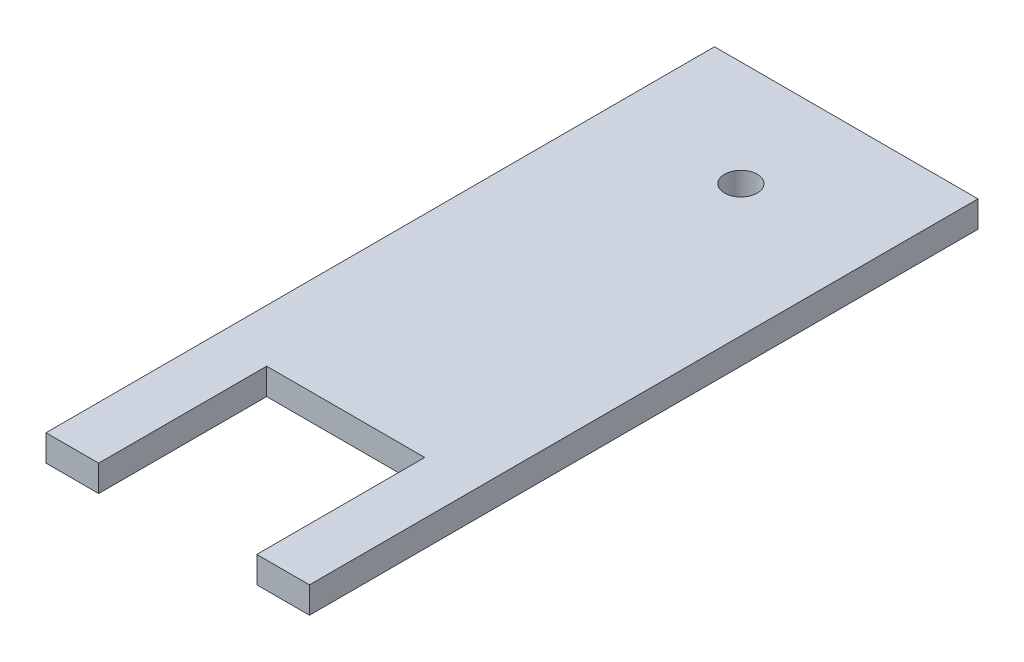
from build123d import *

# Parameters (mm, degrees)
SKETCH1_W           = 25.4
SKETCH1_H           = 80.9625
BOSS_EXTRUDE1_DEPTH = 12.7


with BuildPart() as part:
    # Sketch1 → Boss-Extrude1 (new body)
    with BuildSketch(Plane(origin=(0, 0, 0), x_dir=(1, 0, 0), z_dir=(0, 1, 0))):
        with BuildLine():
            Line((63.5, 182.626), (63.5, 0))
            Line((63.5, 0), (101.6, 0))
            Line((101.6, 0), (127, 0))
            Line((127, 0), (127, 241.3))
            Line((127, 241.3), (63.5, 241.3))
            Line((63.5, 241.3), (63.5, 198.374))
            ThreePointArc((63.5, 198.374), (69.067758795, 196.067758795), (71.374, 190.5))
            ThreePointArc((71.374, 190.5), (69.067758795, 184.932241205), (63.5, 182.626))
        make_face()
        with BuildLine():
            Line((0, 241.3), (0, 0))
            Line((0, 0), (25.4, 0))
            Line((25.4, 0), (63.5, 0))
            Line((63.5, 0), (63.5, 182.626))
            ThreePointArc((63.5, 182.626), (55.626, 190.5), (63.5, 198.374))
            Line((63.5, 198.374), (63.5, 241.3))
            Line((63.5, 241.3), (0, 241.3))
        make_face()
        with Locations((114.3, -40.48125)):
            Rectangle(SKETCH1_W, SKETCH1_H)
        with Locations((12.7, -40.48125)):
            Rectangle(SKETCH1_W, SKETCH1_H)
    extrude(amount=BOSS_EXTRUDE1_DEPTH)


solid = part.part
